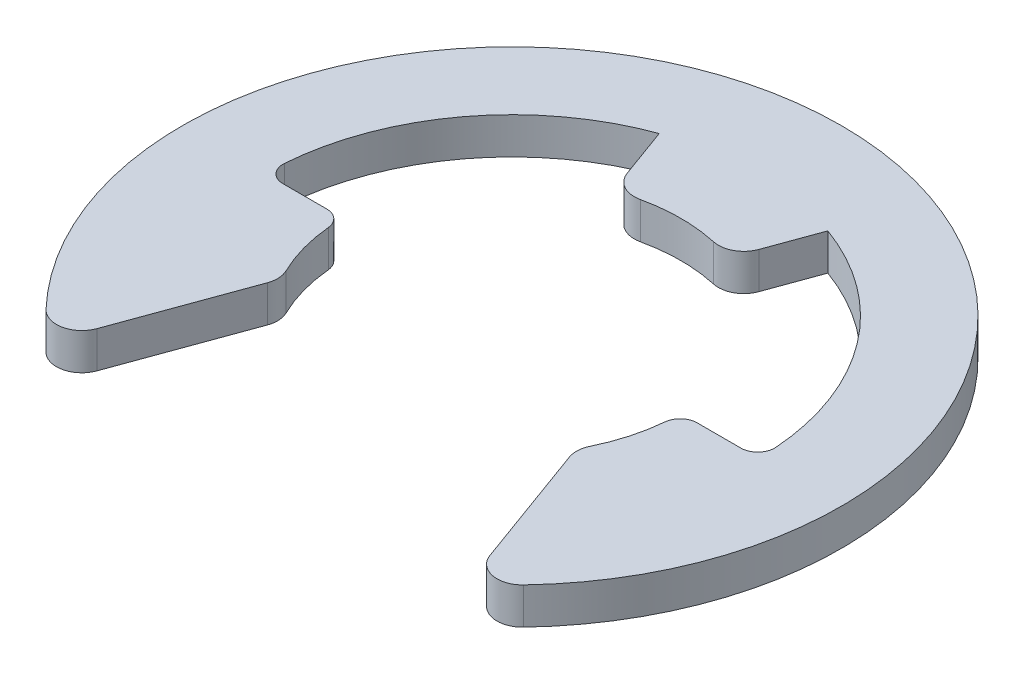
ISO-10303-21;
HEADER;
FILE_DESCRIPTION(('STEP AP214'),'2;1');
FILE_NAME('part.step','',(''),(''),'','','');
FILE_SCHEMA(('AUTOMOTIVE_DESIGN { 1 0 10303 214 1 1 1 1 }'));
ENDSEC;
DATA;
#1=APPLICATION_CONTEXT('core data for automotive mechanical design processes');
#2=APPLICATION_PROTOCOL_DEFINITION('international standard','automotive_design',2000,#1);
#3=PRODUCT_CONTEXT('',#1,'mechanical');
#4=PRODUCT('Part','Part','',(#3));
#5=PRODUCT_RELATED_PRODUCT_CATEGORY('part','',(#4));
#6=PRODUCT_DEFINITION_FORMATION('','',#4);
#7=PRODUCT_DEFINITION_CONTEXT('part definition',#1,'design');
#8=PRODUCT_DEFINITION('design','',#6,#7);
#9=PRODUCT_DEFINITION_SHAPE('','',#8);
#10=(LENGTH_UNIT() NAMED_UNIT(*) SI_UNIT(.MILLI.,.METRE.));
#11=(NAMED_UNIT(*) PLANE_ANGLE_UNIT() SI_UNIT($,.RADIAN.));
#12=(NAMED_UNIT(*) SI_UNIT($,.STERADIAN.) SOLID_ANGLE_UNIT());
#13=UNCERTAINTY_MEASURE_WITH_UNIT(LENGTH_MEASURE(1.E-05),#10,'distance_accuracy_value','');
#14=(GEOMETRIC_REPRESENTATION_CONTEXT(3) GLOBAL_UNCERTAINTY_ASSIGNED_CONTEXT((#13)) GLOBAL_UNIT_ASSIGNED_CONTEXT((#10,
#11,#12)) REPRESENTATION_CONTEXT('',''));
#15=CARTESIAN_POINT('',(0.,0.,0.));
#16=DIRECTION('',(0.,0.,1.));
#17=DIRECTION('',(1.,0.,0.));
#18=AXIS2_PLACEMENT_3D('',#15,#16,#17);
#19=CARTESIAN_POINT('',(0.,0.65,0.));
#20=DIRECTION('',(0.,-1.,0.));
#21=DIRECTION('',(0.,0.,-1.));
#22=AXIS2_PLACEMENT_3D('',#19,#20,#21);
#23=CYLINDRICAL_SURFACE('',#22,8.75);
#24=CARTESIAN_POINT('',(0.,0.65,0.));
#25=DIRECTION('',(0.,-1.,0.));
#26=DIRECTION('',(0.,0.,1.));
#27=AXIS2_PLACEMENT_3D('',#24,#25,#26);
#28=CIRCLE('',#27,8.75);
#29=CARTESIAN_POINT('',(-8.72625593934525,0.65,-0.644171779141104));
#30=VERTEX_POINT('',#29);
#31=CARTESIAN_POINT('',(-2.99267625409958,0.65,-8.22231043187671));
#32=VERTEX_POINT('',#31);
#33=EDGE_CURVE('E187',#30,#32,#28,.T.);
#34=ORIENTED_EDGE('',*,*,#33,.F.);
#35=DIRECTION('',(0.,-1.,0.));
#36=VECTOR('',#35,1.);
#37=CARTESIAN_POINT('',(-8.72625593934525,0.65,-0.644171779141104));
#38=LINE('',#37,#36);
#39=CARTESIAN_POINT('',(-8.72625593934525,-0.65,-0.644171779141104));
#40=VERTEX_POINT('',#39);
#41=EDGE_CURVE('E327',#30,#40,#38,.T.);
#42=ORIENTED_EDGE('',*,*,#41,.T.);
#43=CARTESIAN_POINT('',(0.,-0.65,0.));
#44=DIRECTION('',(0.,-1.,0.));
#45=DIRECTION('',(0.,0.,1.));
#46=AXIS2_PLACEMENT_3D('',#43,#44,#45);
#47=CIRCLE('',#46,8.75);
#48=CARTESIAN_POINT('',(-2.99267625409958,-0.65,-8.22231043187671));
#49=VERTEX_POINT('',#48);
#50=EDGE_CURVE('E211',#40,#49,#47,.T.);
#51=ORIENTED_EDGE('',*,*,#50,.T.);
#52=DIRECTION('',(0.,-1.,0.));
#53=VECTOR('',#52,1.);
#54=CARTESIAN_POINT('',(-2.99267625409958,0.65,-8.22231043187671));
#55=LINE('',#54,#53);
#56=EDGE_CURVE('E204',#32,#49,#55,.T.);
#57=ORIENTED_EDGE('',*,*,#56,.F.);
#58=EDGE_LOOP('',(#34,#42,#51,#57));
#59=FACE_BOUND('',#58,.T.);
#60=ADVANCED_FACE('F39',(#59),#23,.F.);
#61=CARTESIAN_POINT('',(-2.99267625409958,0.65,-8.22231043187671));
#62=DIRECTION('',(0.93969262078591,0.,-0.342020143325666));
#63=DIRECTION('',(-0.342020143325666,0.,-0.93969262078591));
#64=AXIS2_PLACEMENT_3D('',#61,#62,#63);
#65=PLANE('',#64);
#66=DIRECTION('',(0.342020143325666,0.,0.93969262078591));
#67=VECTOR('',#66,1.);
#68=CARTESIAN_POINT('',(-2.99267625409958,-0.65,-8.22231043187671));
#69=LINE('',#68,#67);
#70=CARTESIAN_POINT('',(-2.33977777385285,-0.65,-6.42848660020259));
#71=VERTEX_POINT('',#70);
#72=EDGE_CURVE('E447',#49,#71,#69,.T.);
#73=ORIENTED_EDGE('',*,*,#72,.T.);
#74=DIRECTION('',(0.,-1.,0.));
#75=VECTOR('',#74,1.);
#76=CARTESIAN_POINT('',(-2.33977777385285,0.65,-6.42848660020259));
#77=LINE('',#76,#75);
#78=CARTESIAN_POINT('',(-2.33977777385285,0.65,-6.42848660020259));
#79=VERTEX_POINT('',#78);
#80=EDGE_CURVE('E206',#71,#79,#77,.F.);
#81=ORIENTED_EDGE('',*,*,#80,.T.);
#82=DIRECTION('',(0.342020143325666,0.,0.93969262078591));
#83=VECTOR('',#82,1.);
#84=CARTESIAN_POINT('',(-2.99267625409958,0.65,-8.22231043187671));
#85=LINE('',#84,#83);
#86=EDGE_CURVE('E191',#32,#79,#85,.T.);
#87=ORIENTED_EDGE('',*,*,#86,.F.);
#88=ORIENTED_EDGE('',*,*,#56,.T.);
#89=EDGE_LOOP('',(#73,#81,#87,#88));
#90=FACE_BOUND('',#89,.T.);
#91=ADVANCED_FACE('F203',(#90),#65,.F.);
#92=CARTESIAN_POINT('',(0.,0.65,0.));
#93=DIRECTION('',(0.,-1.,0.));
#94=DIRECTION('',(0.,0.,-1.));
#95=AXIS2_PLACEMENT_3D('',#92,#93,#94);
#96=CYLINDRICAL_SURFACE('',#95,6.);
#97=CARTESIAN_POINT('',(0.,-0.65,0.));
#98=DIRECTION('',(0.,-1.,0.));
#99=DIRECTION('',(0.,0.,1.));
#100=AXIS2_PLACEMENT_3D('',#97,#98,#99);
#101=CIRCLE('',#100,6.);
#102=CARTESIAN_POINT('',(-1.29917775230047,-0.65,-5.85765628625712));
#103=VERTEX_POINT('',#102);
#104=CARTESIAN_POINT('',(1.29917775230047,-0.65,-5.85765628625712));
#105=VERTEX_POINT('',#104);
#106=EDGE_CURVE('E450',#103,#105,#101,.T.);
#107=ORIENTED_EDGE('',*,*,#106,.T.);
#108=DIRECTION('',(0.,-1.,0.));
#109=VECTOR('',#108,1.);
#110=CARTESIAN_POINT('',(1.29917775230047,0.65,-5.85765628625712));
#111=LINE('',#110,#109);
#112=CARTESIAN_POINT('',(1.29917775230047,0.65,-5.85765628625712));
#113=VERTEX_POINT('',#112);
#114=EDGE_CURVE('E290',#105,#113,#111,.F.);
#115=ORIENTED_EDGE('',*,*,#114,.T.);
#116=CARTESIAN_POINT('',(0.,0.65,0.));
#117=DIRECTION('',(0.,-1.,0.));
#118=DIRECTION('',(0.,0.,1.));
#119=AXIS2_PLACEMENT_3D('',#116,#117,#118);
#120=CIRCLE('',#119,6.);
#121=CARTESIAN_POINT('',(-1.29917775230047,0.65,-5.85765628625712));
#122=VERTEX_POINT('',#121);
#123=EDGE_CURVE('E208',#122,#113,#120,.T.);
#124=ORIENTED_EDGE('',*,*,#123,.F.);
#125=DIRECTION('',(0.,-1.,0.));
#126=VECTOR('',#125,1.);
#127=CARTESIAN_POINT('',(-1.29917775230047,0.65,-5.85765628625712));
#128=LINE('',#127,#126);
#129=EDGE_CURVE('E286',#122,#103,#128,.T.);
#130=ORIENTED_EDGE('',*,*,#129,.T.);
#131=EDGE_LOOP('',(#107,#115,#124,#130));
#132=FACE_BOUND('',#131,.T.);
#133=ADVANCED_FACE('F371',(#132),#96,.F.);
#134=CARTESIAN_POINT('',(2.052120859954,0.65,-5.63815572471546));
#135=DIRECTION('',(-0.93969262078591,0.,-0.342020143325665));
#136=DIRECTION('',(-0.342020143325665,0.,0.93969262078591));
#137=AXIS2_PLACEMENT_3D('',#134,#135,#136);
#138=PLANE('',#137);
#139=DIRECTION('',(0.342020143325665,0.,-0.93969262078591));
#140=VECTOR('',#139,1.);
#141=CARTESIAN_POINT('',(2.052120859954,0.65,-5.63815572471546));
#142=LINE('',#141,#140);
#143=CARTESIAN_POINT('',(2.33977777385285,0.65,-6.42848660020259));
#144=VERTEX_POINT('',#143);
#145=CARTESIAN_POINT('',(2.99267625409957,0.65,-8.22231043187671));
#146=VERTEX_POINT('',#145);
#147=EDGE_CURVE('E424',#144,#146,#142,.T.);
#148=ORIENTED_EDGE('',*,*,#147,.F.);
#149=DIRECTION('',(0.,-1.,0.));
#150=VECTOR('',#149,1.);
#151=CARTESIAN_POINT('',(2.33977777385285,0.65,-6.42848660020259));
#152=LINE('',#151,#150);
#153=CARTESIAN_POINT('',(2.33977777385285,-0.65,-6.42848660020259));
#154=VERTEX_POINT('',#153);
#155=EDGE_CURVE('E282',#144,#154,#152,.T.);
#156=ORIENTED_EDGE('',*,*,#155,.T.);
#157=DIRECTION('',(0.342020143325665,0.,-0.93969262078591));
#158=VECTOR('',#157,1.);
#159=CARTESIAN_POINT('',(2.052120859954,-0.65,-5.63815572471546));
#160=LINE('',#159,#158);
#161=CARTESIAN_POINT('',(2.99267625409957,-0.65,-8.22231043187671));
#162=VERTEX_POINT('',#161);
#163=EDGE_CURVE('E454',#154,#162,#160,.T.);
#164=ORIENTED_EDGE('',*,*,#163,.T.);
#165=DIRECTION('',(0.,-1.,0.));
#166=VECTOR('',#165,1.);
#167=CARTESIAN_POINT('',(2.99267625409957,0.65,-8.22231043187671));
#168=LINE('',#167,#166);
#169=EDGE_CURVE('E215',#146,#162,#168,.T.);
#170=ORIENTED_EDGE('',*,*,#169,.F.);
#171=EDGE_LOOP('',(#148,#156,#164,#170));
#172=FACE_BOUND('',#171,.T.);
#173=ADVANCED_FACE('F527',(#172),#138,.F.);
#174=CARTESIAN_POINT('',(0.,0.65,0.));
#175=DIRECTION('',(0.,-1.,0.));
#176=DIRECTION('',(0.,0.,-1.));
#177=AXIS2_PLACEMENT_3D('',#174,#175,#176);
#178=CYLINDRICAL_SURFACE('',#177,8.75);
#179=CARTESIAN_POINT('',(0.,-0.65,0.));
#180=DIRECTION('',(0.,-1.,0.));
#181=DIRECTION('',(0.,0.,1.));
#182=AXIS2_PLACEMENT_3D('',#179,#180,#181);
#183=CIRCLE('',#182,8.75);
#184=CARTESIAN_POINT('',(8.72625593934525,-0.65,-0.644171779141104));
#185=VERTEX_POINT('',#184);
#186=EDGE_CURVE('E457',#162,#185,#183,.T.);
#187=ORIENTED_EDGE('',*,*,#186,.T.);
#188=DIRECTION('',(0.,-1.,0.));
#189=VECTOR('',#188,1.);
#190=CARTESIAN_POINT('',(8.72625593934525,0.65,-0.644171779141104));
#191=LINE('',#190,#189);
#192=CARTESIAN_POINT('',(8.72625593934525,0.65,-0.644171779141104));
#193=VERTEX_POINT('',#192);
#194=EDGE_CURVE('E308',#185,#193,#191,.F.);
#195=ORIENTED_EDGE('',*,*,#194,.T.);
#196=CARTESIAN_POINT('',(0.,0.65,0.));
#197=DIRECTION('',(0.,-1.,0.));
#198=DIRECTION('',(0.,0.,1.));
#199=AXIS2_PLACEMENT_3D('',#196,#197,#198);
#200=CIRCLE('',#199,8.75);
#201=EDGE_CURVE('E411',#146,#193,#200,.T.);
#202=ORIENTED_EDGE('',*,*,#201,.F.);
#203=ORIENTED_EDGE('',*,*,#169,.T.);
#204=EDGE_LOOP('',(#187,#195,#202,#203));
#205=FACE_BOUND('',#204,.T.);
#206=ADVANCED_FACE('F521',(#205),#178,.F.);
#207=CARTESIAN_POINT('',(6.,0.65,0.));
#208=DIRECTION('',(0.,0.,1.));
#209=DIRECTION('',(1.,0.,0.));
#210=AXIS2_PLACEMENT_3D('',#207,#208,#209);
#211=PLANE('',#210);
#212=DIRECTION('',(-1.,0.,0.));
#213=VECTOR('',#212,1.);
#214=CARTESIAN_POINT('',(6.,0.65,0.));
#215=LINE('',#214,#213);
#216=CARTESIAN_POINT('',(8.12788410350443,0.65,0.));
#217=VERTEX_POINT('',#216);
#218=CARTESIAN_POINT('',(6.57267069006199,0.65,0.));
#219=VERTEX_POINT('',#218);
#220=EDGE_CURVE('E408',#217,#219,#215,.T.);
#221=ORIENTED_EDGE('',*,*,#220,.F.);
#222=DIRECTION('',(0.,1.,0.));
#223=VECTOR('',#222,1.);
#224=CARTESIAN_POINT('',(8.12788410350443,-0.65,0.));
#225=LINE('',#224,#223);
#226=CARTESIAN_POINT('',(8.12788410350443,-0.65,0.));
#227=VERTEX_POINT('',#226);
#228=EDGE_CURVE('E305',#217,#227,#225,.F.);
#229=ORIENTED_EDGE('',*,*,#228,.T.);
#230=DIRECTION('',(-1.,0.,0.));
#231=VECTOR('',#230,1.);
#232=CARTESIAN_POINT('',(6.,-0.65,0.));
#233=LINE('',#232,#231);
#234=CARTESIAN_POINT('',(6.57267069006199,-0.65,0.));
#235=VERTEX_POINT('',#234);
#236=EDGE_CURVE('E461',#227,#235,#233,.T.);
#237=ORIENTED_EDGE('',*,*,#236,.T.);
#238=DIRECTION('',(0.,-1.,0.));
#239=VECTOR('',#238,1.);
#240=CARTESIAN_POINT('',(6.57267069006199,0.65,0.));
#241=LINE('',#240,#239);
#242=EDGE_CURVE('E302',#235,#219,#241,.F.);
#243=ORIENTED_EDGE('',*,*,#242,.T.);
#244=EDGE_LOOP('',(#221,#229,#237,#243));
#245=FACE_BOUND('',#244,.T.);
#246=ADVANCED_FACE('F413',(#245),#211,.F.);
#247=CARTESIAN_POINT('',(0.,0.65,0.));
#248=DIRECTION('',(0.,-1.,0.));
#249=DIRECTION('',(0.,0.,-1.));
#250=AXIS2_PLACEMENT_3D('',#247,#248,#249);
#251=CYLINDRICAL_SURFACE('',#250,6.);
#252=CARTESIAN_POINT('',(0.,0.65,0.));
#253=DIRECTION('',(0.,-1.,0.));
#254=DIRECTION('',(0.,0.,1.));
#255=AXIS2_PLACEMENT_3D('',#252,#253,#254);
#256=CIRCLE('',#255,6.);
#257=CARTESIAN_POINT('',(5.97515517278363,0.65,0.545454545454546));
#258=VERTEX_POINT('',#257);
#259=CARTESIAN_POINT('',(5.39698560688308,0.65,2.62155418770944));
#260=VERTEX_POINT('',#259);
#261=EDGE_CURVE('E418',#258,#260,#256,.T.);
#262=ORIENTED_EDGE('',*,*,#261,.F.);
#263=DIRECTION('',(0.,-1.,0.));
#264=VECTOR('',#263,1.);
#265=CARTESIAN_POINT('',(5.97515517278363,0.65,0.545454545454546));
#266=LINE('',#265,#264);
#267=CARTESIAN_POINT('',(5.97515517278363,-0.65,0.545454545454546));
#268=VERTEX_POINT('',#267);
#269=EDGE_CURVE('E311',#258,#268,#266,.T.);
#270=ORIENTED_EDGE('',*,*,#269,.T.);
#271=CARTESIAN_POINT('',(0.,-0.65,0.));
#272=DIRECTION('',(0.,-1.,0.));
#273=DIRECTION('',(0.,0.,1.));
#274=AXIS2_PLACEMENT_3D('',#271,#272,#273);
#275=CIRCLE('',#274,6.);
#276=CARTESIAN_POINT('',(5.39698560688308,-0.65,2.62155418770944));
#277=VERTEX_POINT('',#276);
#278=EDGE_CURVE('E464',#268,#277,#275,.T.);
#279=ORIENTED_EDGE('',*,*,#278,.T.);
#280=DIRECTION('',(0.,-1.,0.));
#281=VECTOR('',#280,1.);
#282=CARTESIAN_POINT('',(5.39698560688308,0.65,2.62155418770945));
#283=LINE('',#282,#281);
#284=EDGE_CURVE('E250',#277,#260,#283,.F.);
#285=ORIENTED_EDGE('',*,*,#284,.T.);
#286=EDGE_LOOP('',(#262,#270,#279,#285));
#287=FACE_BOUND('',#286,.T.);
#288=ADVANCED_FACE('F512',(#287),#251,.F.);
#289=CARTESIAN_POINT('',(5.22499999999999,0.65,2.94947029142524));
#290=DIRECTION('',(0.939692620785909,0.,-0.342020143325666));
#291=DIRECTION('',(-0.342020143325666,0.,-0.939692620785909));
#292=AXIS2_PLACEMENT_3D('',#289,#290,#291);
#293=PLANE('',#292);
#294=DIRECTION('',(0.342020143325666,0.,0.939692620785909));
#295=VECTOR('',#294,1.);
#296=CARTESIAN_POINT('',(5.22499999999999,0.65,2.94947029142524));
#297=LINE('',#296,#295);
#298=CARTESIAN_POINT('',(5.36081008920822,0.65,3.32260544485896));
#299=VERTEX_POINT('',#298);
#300=CARTESIAN_POINT('',(6.97460574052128,0.65,7.75647255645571));
#301=VERTEX_POINT('',#300);
#302=EDGE_CURVE('E421',#299,#301,#297,.T.);
#303=ORIENTED_EDGE('',*,*,#302,.F.);
#304=DIRECTION('',(0.,-1.,0.));
#305=VECTOR('',#304,1.);
#306=CARTESIAN_POINT('',(5.36081008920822,0.65,3.32260544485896));
#307=LINE('',#306,#305);
#308=CARTESIAN_POINT('',(5.36081008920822,-0.65,3.32260544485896));
#309=VERTEX_POINT('',#308);
#310=EDGE_CURVE('E220',#299,#309,#307,.T.);
#311=ORIENTED_EDGE('',*,*,#310,.T.);
#312=DIRECTION('',(0.342020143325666,0.,0.939692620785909));
#313=VECTOR('',#312,1.);
#314=CARTESIAN_POINT('',(5.22499999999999,-0.65,2.94947029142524));
#315=LINE('',#314,#313);
#316=CARTESIAN_POINT('',(6.97460574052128,-0.65,7.75647255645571));
#317=VERTEX_POINT('',#316);
#318=EDGE_CURVE('E467',#309,#317,#315,.T.);
#319=ORIENTED_EDGE('',*,*,#318,.T.);
#320=DIRECTION('',(0.,-1.,0.));
#321=VECTOR('',#320,1.);
#322=CARTESIAN_POINT('',(6.97460574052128,0.65,7.75647255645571));
#323=LINE('',#322,#321);
#324=EDGE_CURVE('E214',#317,#301,#323,.F.);
#325=ORIENTED_EDGE('',*,*,#324,.T.);
#326=EDGE_LOOP('',(#303,#311,#319,#325));
#327=FACE_BOUND('',#326,.T.);
#328=ADVANCED_FACE('F506',(#327),#293,.F.);
#329=CARTESIAN_POINT('',(0.,0.65,0.));
#330=DIRECTION('',(0.,-1.,0.));
#331=DIRECTION('',(0.,0.,-1.));
#332=AXIS2_PLACEMENT_3D('',#329,#330,#331);
#333=CYLINDRICAL_SURFACE('',#332,11.7);
#334=CARTESIAN_POINT('',(0.,0.65,0.));
#335=DIRECTION('',(0.,1.,0.));
#336=DIRECTION('',(0.,0.,1.));
#337=AXIS2_PLACEMENT_3D('',#334,#335,#336);
#338=CIRCLE('',#337,11.7);
#339=CARTESIAN_POINT('',(8.47202319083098,0.65,8.06937562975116));
#340=VERTEX_POINT('',#339);
#341=CARTESIAN_POINT('',(-8.47202319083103,0.65,8.06937562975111));
#342=VERTEX_POINT('',#341);
#343=EDGE_CURVE('E431',#340,#342,#338,.T.);
#344=ORIENTED_EDGE('',*,*,#343,.F.);
#345=DIRECTION('',(0.,-1.,0.));
#346=VECTOR('',#345,1.);
#347=CARTESIAN_POINT('',(8.47202319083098,0.65,8.06937562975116));
#348=LINE('',#347,#346);
#349=CARTESIAN_POINT('',(8.47202319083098,-0.65,8.06937562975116));
#350=VERTEX_POINT('',#349);
#351=EDGE_CURVE('E298',#340,#350,#348,.T.);
#352=ORIENTED_EDGE('',*,*,#351,.T.);
#353=CARTESIAN_POINT('',(0.,-0.65,0.));
#354=DIRECTION('',(0.,1.,0.));
#355=DIRECTION('',(0.,0.,1.));
#356=AXIS2_PLACEMENT_3D('',#353,#354,#355);
#357=CIRCLE('',#356,11.7);
#358=CARTESIAN_POINT('',(-8.47202319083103,-0.65,8.06937562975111));
#359=VERTEX_POINT('',#358);
#360=EDGE_CURVE('E471',#350,#359,#357,.T.);
#361=ORIENTED_EDGE('',*,*,#360,.T.);
#362=DIRECTION('',(0.,-1.,0.));
#363=VECTOR('',#362,1.);
#364=CARTESIAN_POINT('',(-8.47202319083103,0.65,8.06937562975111));
#365=LINE('',#364,#363);
#366=EDGE_CURVE('E295',#359,#342,#365,.F.);
#367=ORIENTED_EDGE('',*,*,#366,.T.);
#368=EDGE_LOOP('',(#344,#352,#361,#367));
#369=FACE_BOUND('',#368,.T.);
#370=ADVANCED_FACE('F499',(#369),#333,.T.);
#371=CARTESIAN_POINT('',(-7.43849299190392,0.65,9.03099230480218));
#372=DIRECTION('',(-0.939692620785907,0.,-0.342020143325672));
#373=DIRECTION('',(-0.342020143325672,0.,0.939692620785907));
#374=AXIS2_PLACEMENT_3D('',#371,#372,#373);
#375=PLANE('',#374);
#376=DIRECTION('',(0.342020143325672,0.,-0.939692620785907));
#377=VECTOR('',#376,1.);
#378=CARTESIAN_POINT('',(-7.43849299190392,-0.65,9.03099230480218));
#379=LINE('',#378,#377);
#380=CARTESIAN_POINT('',(-6.97460574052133,-0.65,7.75647255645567));
#381=VERTEX_POINT('',#380);
#382=CARTESIAN_POINT('',(-5.36081008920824,-0.65,3.32260544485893));
#383=VERTEX_POINT('',#382);
#384=EDGE_CURVE('E475',#381,#383,#379,.T.);
#385=ORIENTED_EDGE('',*,*,#384,.T.);
#386=DIRECTION('',(0.,-1.,0.));
#387=VECTOR('',#386,1.);
#388=CARTESIAN_POINT('',(-5.36081008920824,0.65,3.32260544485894));
#389=LINE('',#388,#387);
#390=CARTESIAN_POINT('',(-5.36081008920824,0.65,3.32260544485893));
#391=VERTEX_POINT('',#390);
#392=EDGE_CURVE('E279',#383,#391,#389,.F.);
#393=ORIENTED_EDGE('',*,*,#392,.T.);
#394=DIRECTION('',(0.342020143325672,0.,-0.939692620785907));
#395=VECTOR('',#394,1.);
#396=CARTESIAN_POINT('',(-7.43849299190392,0.65,9.03099230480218));
#397=LINE('',#396,#395);
#398=CARTESIAN_POINT('',(-6.97460574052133,0.65,7.75647255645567));
#399=VERTEX_POINT('',#398);
#400=EDGE_CURVE('E435',#399,#391,#397,.T.);
#401=ORIENTED_EDGE('',*,*,#400,.F.);
#402=DIRECTION('',(0.,-1.,0.));
#403=VECTOR('',#402,1.);
#404=CARTESIAN_POINT('',(-6.97460574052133,0.65,7.75647255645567));
#405=LINE('',#404,#403);
#406=EDGE_CURVE('E275',#399,#381,#405,.T.);
#407=ORIENTED_EDGE('',*,*,#406,.T.);
#408=EDGE_LOOP('',(#385,#393,#401,#407));
#409=FACE_BOUND('',#408,.T.);
#410=ADVANCED_FACE('F491',(#409),#375,.F.);
#411=CARTESIAN_POINT('',(0.,0.65,0.));
#412=DIRECTION('',(0.,-1.,0.));
#413=DIRECTION('',(0.,0.,-1.));
#414=AXIS2_PLACEMENT_3D('',#411,#412,#413);
#415=CYLINDRICAL_SURFACE('',#414,6.);
#416=CARTESIAN_POINT('',(0.,-0.65,0.));
#417=DIRECTION('',(0.,-1.,0.));
#418=DIRECTION('',(0.,0.,1.));
#419=AXIS2_PLACEMENT_3D('',#416,#417,#418);
#420=CIRCLE('',#419,6.);
#421=CARTESIAN_POINT('',(-5.39698560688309,-0.65,2.62155418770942));
#422=VERTEX_POINT('',#421);
#423=CARTESIAN_POINT('',(-5.97515517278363,-0.65,0.545454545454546));
#424=VERTEX_POINT('',#423);
#425=EDGE_CURVE('E354',#422,#424,#420,.T.);
#426=ORIENTED_EDGE('',*,*,#425,.T.);
#427=DIRECTION('',(0.,-1.,0.));
#428=VECTOR('',#427,1.);
#429=CARTESIAN_POINT('',(-5.97515517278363,0.65,0.545454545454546));
#430=LINE('',#429,#428);
#431=CARTESIAN_POINT('',(-5.97515517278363,0.65,0.545454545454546));
#432=VERTEX_POINT('',#431);
#433=EDGE_CURVE('E336',#424,#432,#430,.F.);
#434=ORIENTED_EDGE('',*,*,#433,.T.);
#435=CARTESIAN_POINT('',(0.,0.65,0.));
#436=DIRECTION('',(0.,-1.,0.));
#437=DIRECTION('',(0.,0.,1.));
#438=AXIS2_PLACEMENT_3D('',#435,#436,#437);
#439=CIRCLE('',#438,6.);
#440=CARTESIAN_POINT('',(-5.39698560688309,0.65,2.62155418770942));
#441=VERTEX_POINT('',#440);
#442=EDGE_CURVE('E439',#441,#432,#439,.T.);
#443=ORIENTED_EDGE('',*,*,#442,.F.);
#444=DIRECTION('',(0.,-1.,0.));
#445=VECTOR('',#444,1.);
#446=CARTESIAN_POINT('',(-5.39698560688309,0.65,2.62155418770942));
#447=LINE('',#446,#445);
#448=EDGE_CURVE('E271',#441,#422,#447,.T.);
#449=ORIENTED_EDGE('',*,*,#448,.T.);
#450=EDGE_LOOP('',(#426,#434,#443,#449));
#451=FACE_BOUND('',#450,.T.);
#452=ADVANCED_FACE('F483',(#451),#415,.F.);
#453=CARTESIAN_POINT('',(-6.,0.65,0.));
#454=DIRECTION('',(0.,0.,1.));
#455=DIRECTION('',(1.,0.,0.));
#456=AXIS2_PLACEMENT_3D('',#453,#454,#455);
#457=PLANE('',#456);
#458=DIRECTION('',(-1.,0.,0.));
#459=VECTOR('',#458,1.);
#460=CARTESIAN_POINT('',(-6.,-0.65,0.));
#461=LINE('',#460,#459);
#462=CARTESIAN_POINT('',(-6.57267069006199,-0.65,0.));
#463=VERTEX_POINT('',#462);
#464=CARTESIAN_POINT('',(-8.12788410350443,-0.65,0.));
#465=VERTEX_POINT('',#464);
#466=EDGE_CURVE('E198',#463,#465,#461,.T.);
#467=ORIENTED_EDGE('',*,*,#466,.T.);
#468=DIRECTION('',(0.,1.,0.));
#469=VECTOR('',#468,1.);
#470=CARTESIAN_POINT('',(-8.12788410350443,0.65,0.));
#471=LINE('',#470,#469);
#472=CARTESIAN_POINT('',(-8.12788410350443,0.65,0.));
#473=VERTEX_POINT('',#472);
#474=EDGE_CURVE('E61',#465,#473,#471,.T.);
#475=ORIENTED_EDGE('',*,*,#474,.T.);
#476=DIRECTION('',(-1.,0.,0.));
#477=VECTOR('',#476,1.);
#478=CARTESIAN_POINT('',(-6.,0.65,0.));
#479=LINE('',#478,#477);
#480=CARTESIAN_POINT('',(-6.57267069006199,0.65,0.));
#481=VERTEX_POINT('',#480);
#482=EDGE_CURVE('E224',#481,#473,#479,.T.);
#483=ORIENTED_EDGE('',*,*,#482,.F.);
#484=DIRECTION('',(0.,-1.,0.));
#485=VECTOR('',#484,1.);
#486=CARTESIAN_POINT('',(-6.57267069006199,0.65,0.));
#487=LINE('',#486,#485);
#488=EDGE_CURVE('E330',#481,#463,#487,.T.);
#489=ORIENTED_EDGE('',*,*,#488,.T.);
#490=EDGE_LOOP('',(#467,#475,#483,#489));
#491=FACE_BOUND('',#490,.T.);
#492=ADVANCED_FACE('F351',(#491),#457,.F.);
#493=CARTESIAN_POINT('',(0.,0.65,0.));
#494=DIRECTION('',(0.,1.,0.));
#495=DIRECTION('',(0.,0.,1.));
#496=AXIS2_PLACEMENT_3D('',#493,#494,#495);
#497=PLANE('',#496);
#498=ORIENTED_EDGE('',*,*,#220,.T.);
#499=CARTESIAN_POINT('',(6.57267069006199,0.65,0.6));
#500=DIRECTION('',(0.,1.,0.));
#501=DIRECTION('',(0.,0.,1.));
#502=AXIS2_PLACEMENT_3D('',#499,#500,#501);
#503=CIRCLE('',#502,0.6);
#504=EDGE_CURVE('E324',#219,#258,#503,.T.);
#505=ORIENTED_EDGE('',*,*,#504,.T.);
#506=ORIENTED_EDGE('',*,*,#261,.T.);
#507=CARTESIAN_POINT('',(6.20653344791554,0.65,3.01478731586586));
#508=DIRECTION('',(0.,1.,0.));
#509=DIRECTION('',(0.,0.,1.));
#510=AXIS2_PLACEMENT_3D('',#507,#508,#509);
#511=CIRCLE('',#510,0.9);
#512=EDGE_CURVE('E268',#260,#299,#511,.T.);
#513=ORIENTED_EDGE('',*,*,#512,.T.);
#514=ORIENTED_EDGE('',*,*,#302,.T.);
#515=CARTESIAN_POINT('',(7.8203290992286,0.65,7.44865442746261));
#516=DIRECTION('',(0.,1.,0.));
#517=DIRECTION('',(0.,0.,1.));
#518=AXIS2_PLACEMENT_3D('',#515,#516,#517);
#519=CIRCLE('',#518,0.9);
#520=EDGE_CURVE('E257',#301,#340,#519,.T.);
#521=ORIENTED_EDGE('',*,*,#520,.T.);
#522=ORIENTED_EDGE('',*,*,#343,.T.);
#523=CARTESIAN_POINT('',(-7.82032909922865,0.65,7.44865442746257));
#524=DIRECTION('',(0.,1.,0.));
#525=DIRECTION('',(0.,0.,1.));
#526=AXIS2_PLACEMENT_3D('',#523,#524,#525);
#527=CIRCLE('',#526,0.9);
#528=EDGE_CURVE('E254',#342,#399,#527,.T.);
#529=ORIENTED_EDGE('',*,*,#528,.T.);
#530=ORIENTED_EDGE('',*,*,#400,.T.);
#531=CARTESIAN_POINT('',(-6.20653344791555,0.65,3.01478731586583));
#532=DIRECTION('',(0.,1.,0.));
#533=DIRECTION('',(0.,0.,1.));
#534=AXIS2_PLACEMENT_3D('',#531,#532,#533);
#535=CIRCLE('',#534,0.9);
#536=EDGE_CURVE('E265',#391,#441,#535,.T.);
#537=ORIENTED_EDGE('',*,*,#536,.T.);
#538=ORIENTED_EDGE('',*,*,#442,.T.);
#539=CARTESIAN_POINT('',(-6.57267069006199,0.65,0.6));
#540=DIRECTION('',(0.,1.,0.));
#541=DIRECTION('',(0.,0.,1.));
#542=AXIS2_PLACEMENT_3D('',#539,#540,#541);
#543=CIRCLE('',#542,0.6);
#544=EDGE_CURVE('E321',#432,#481,#543,.T.);
#545=ORIENTED_EDGE('',*,*,#544,.T.);
#546=ORIENTED_EDGE('',*,*,#482,.T.);
#547=CARTESIAN_POINT('',(-8.12788410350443,0.65,-0.6));
#548=DIRECTION('',(0.,1.,0.));
#549=DIRECTION('',(0.,0.,1.));
#550=AXIS2_PLACEMENT_3D('',#547,#548,#549);
#551=CIRCLE('',#550,0.6);
#552=EDGE_CURVE('E11',#473,#30,#551,.F.);
#553=ORIENTED_EDGE('',*,*,#552,.T.);
#554=ORIENTED_EDGE('',*,*,#33,.T.);
#555=ORIENTED_EDGE('',*,*,#86,.T.);
#556=CARTESIAN_POINT('',(-1.49405441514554,0.65,-6.73630472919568));
#557=DIRECTION('',(0.,1.,0.));
#558=DIRECTION('',(0.,0.,1.));
#559=AXIS2_PLACEMENT_3D('',#556,#557,#558);
#560=CIRCLE('',#559,0.9);
#561=EDGE_CURVE('E260',#79,#122,#560,.T.);
#562=ORIENTED_EDGE('',*,*,#561,.T.);
#563=ORIENTED_EDGE('',*,*,#123,.T.);
#564=CARTESIAN_POINT('',(1.49405441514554,0.65,-6.73630472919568));
#565=DIRECTION('',(0.,1.,0.));
#566=DIRECTION('',(0.,0.,1.));
#567=AXIS2_PLACEMENT_3D('',#564,#565,#566);
#568=CIRCLE('',#567,0.9);
#569=EDGE_CURVE('E263',#113,#144,#568,.T.);
#570=ORIENTED_EDGE('',*,*,#569,.T.);
#571=ORIENTED_EDGE('',*,*,#147,.T.);
#572=ORIENTED_EDGE('',*,*,#201,.T.);
#573=CARTESIAN_POINT('',(8.12788410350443,0.65,-0.6));
#574=DIRECTION('',(0.,1.,0.));
#575=DIRECTION('',(0.,0.,1.));
#576=AXIS2_PLACEMENT_3D('',#573,#574,#575);
#577=CIRCLE('',#576,0.6);
#578=EDGE_CURVE('E342',#193,#217,#577,.F.);
#579=ORIENTED_EDGE('',*,*,#578,.T.);
#580=EDGE_LOOP('',(#498,#505,#506,#513,#514,#521,#522,#529,#530,#537,#538,#545,#546,#553,#554,
#555,#562,#563,#570,#571,#572,#579));
#581=FACE_BOUND('',#580,.T.);
#582=ADVANCED_FACE('F190',(#581),#497,.T.);
#583=CARTESIAN_POINT('',(0.,-0.65,0.));
#584=DIRECTION('',(0.,1.,0.));
#585=DIRECTION('',(0.,0.,1.));
#586=AXIS2_PLACEMENT_3D('',#583,#584,#585);
#587=PLANE('',#586);
#588=ORIENTED_EDGE('',*,*,#278,.F.);
#589=CARTESIAN_POINT('',(6.57267069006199,-0.65,0.6));
#590=DIRECTION('',(0.,1.,0.));
#591=DIRECTION('',(0.,0.,1.));
#592=AXIS2_PLACEMENT_3D('',#589,#590,#591);
#593=CIRCLE('',#592,0.6);
#594=EDGE_CURVE('E318',#268,#235,#593,.F.);
#595=ORIENTED_EDGE('',*,*,#594,.T.);
#596=ORIENTED_EDGE('',*,*,#236,.F.);
#597=CARTESIAN_POINT('',(8.12788410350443,-0.65,-0.6));
#598=DIRECTION('',(0.,1.,0.));
#599=DIRECTION('',(0.,0.,1.));
#600=AXIS2_PLACEMENT_3D('',#597,#598,#599);
#601=CIRCLE('',#600,0.6);
#602=EDGE_CURVE('E339',#227,#185,#601,.T.);
#603=ORIENTED_EDGE('',*,*,#602,.T.);
#604=ORIENTED_EDGE('',*,*,#186,.F.);
#605=ORIENTED_EDGE('',*,*,#163,.F.);
#606=CARTESIAN_POINT('',(1.49405441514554,-0.65,-6.73630472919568));
#607=DIRECTION('',(0.,1.,0.));
#608=DIRECTION('',(0.,0.,1.));
#609=AXIS2_PLACEMENT_3D('',#606,#607,#608);
#610=CIRCLE('',#609,0.9);
#611=EDGE_CURVE('E240',#154,#105,#610,.F.);
#612=ORIENTED_EDGE('',*,*,#611,.T.);
#613=ORIENTED_EDGE('',*,*,#106,.F.);
#614=CARTESIAN_POINT('',(-1.49405441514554,-0.65,-6.73630472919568));
#615=DIRECTION('',(0.,1.,0.));
#616=DIRECTION('',(0.,0.,1.));
#617=AXIS2_PLACEMENT_3D('',#614,#615,#616);
#618=CIRCLE('',#617,0.9);
#619=EDGE_CURVE('E237',#103,#71,#618,.F.);
#620=ORIENTED_EDGE('',*,*,#619,.T.);
#621=ORIENTED_EDGE('',*,*,#72,.F.);
#622=ORIENTED_EDGE('',*,*,#50,.F.);
#623=CARTESIAN_POINT('',(-8.12788410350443,-0.65,-0.6));
#624=DIRECTION('',(0.,1.,0.));
#625=DIRECTION('',(0.,0.,1.));
#626=AXIS2_PLACEMENT_3D('',#623,#624,#625);
#627=CIRCLE('',#626,0.6);
#628=EDGE_CURVE('E48',#40,#465,#627,.T.);
#629=ORIENTED_EDGE('',*,*,#628,.T.);
#630=ORIENTED_EDGE('',*,*,#466,.F.);
#631=CARTESIAN_POINT('',(-6.57267069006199,-0.65,0.6));
#632=DIRECTION('',(0.,1.,0.));
#633=DIRECTION('',(0.,0.,1.));
#634=AXIS2_PLACEMENT_3D('',#631,#632,#633);
#635=CIRCLE('',#634,0.6);
#636=EDGE_CURVE('E315',#463,#424,#635,.F.);
#637=ORIENTED_EDGE('',*,*,#636,.T.);
#638=ORIENTED_EDGE('',*,*,#425,.F.);
#639=CARTESIAN_POINT('',(-6.20653344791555,-0.65,3.01478731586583));
#640=DIRECTION('',(0.,1.,0.));
#641=DIRECTION('',(0.,0.,1.));
#642=AXIS2_PLACEMENT_3D('',#639,#640,#641);
#643=CIRCLE('',#642,0.9);
#644=EDGE_CURVE('E243',#422,#383,#643,.F.);
#645=ORIENTED_EDGE('',*,*,#644,.T.);
#646=ORIENTED_EDGE('',*,*,#384,.F.);
#647=CARTESIAN_POINT('',(-7.82032909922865,-0.65,7.44865442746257));
#648=DIRECTION('',(0.,1.,0.));
#649=DIRECTION('',(0.,0.,1.));
#650=AXIS2_PLACEMENT_3D('',#647,#648,#649);
#651=CIRCLE('',#650,0.9);
#652=EDGE_CURVE('E231',#381,#359,#651,.F.);
#653=ORIENTED_EDGE('',*,*,#652,.T.);
#654=ORIENTED_EDGE('',*,*,#360,.F.);
#655=CARTESIAN_POINT('',(7.8203290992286,-0.65,7.44865442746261));
#656=DIRECTION('',(0.,1.,0.));
#657=DIRECTION('',(0.,0.,1.));
#658=AXIS2_PLACEMENT_3D('',#655,#656,#657);
#659=CIRCLE('',#658,0.9);
#660=EDGE_CURVE('E234',#350,#317,#659,.F.);
#661=ORIENTED_EDGE('',*,*,#660,.T.);
#662=ORIENTED_EDGE('',*,*,#318,.F.);
#663=CARTESIAN_POINT('',(6.20653344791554,-0.65,3.01478731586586));
#664=DIRECTION('',(0.,1.,0.));
#665=DIRECTION('',(0.,0.,1.));
#666=AXIS2_PLACEMENT_3D('',#663,#664,#665);
#667=CIRCLE('',#666,0.9);
#668=EDGE_CURVE('E246',#309,#277,#667,.F.);
#669=ORIENTED_EDGE('',*,*,#668,.T.);
#670=EDGE_LOOP('',(#588,#595,#596,#603,#604,#605,#612,#613,#620,#621,#622,#629,#630,#637,#638,
#645,#646,#653,#654,#661,#662,#669));
#671=FACE_BOUND('',#670,.T.);
#672=ADVANCED_FACE('F349',(#671),#587,.F.);
#673=CARTESIAN_POINT('',(6.20653344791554,0.65,3.01478731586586));
#674=DIRECTION('',(0.,-1.,0.));
#675=DIRECTION('',(0.,0.,-1.));
#676=AXIS2_PLACEMENT_3D('',#673,#674,#675);
#677=CYLINDRICAL_SURFACE('',#676,0.9);
#678=ORIENTED_EDGE('',*,*,#512,.F.);
#679=ORIENTED_EDGE('',*,*,#284,.F.);
#680=ORIENTED_EDGE('',*,*,#668,.F.);
#681=ORIENTED_EDGE('',*,*,#310,.F.);
#682=EDGE_LOOP('',(#678,#679,#680,#681));
#683=FACE_BOUND('',#682,.T.);
#684=ADVANCED_FACE('F375',(#683),#677,.T.);
#685=CARTESIAN_POINT('',(-6.20653344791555,0.65,3.01478731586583));
#686=DIRECTION('',(0.,-1.,0.));
#687=DIRECTION('',(0.,0.,-1.));
#688=AXIS2_PLACEMENT_3D('',#685,#686,#687);
#689=CYLINDRICAL_SURFACE('',#688,0.9);
#690=ORIENTED_EDGE('',*,*,#536,.F.);
#691=ORIENTED_EDGE('',*,*,#392,.F.);
#692=ORIENTED_EDGE('',*,*,#644,.F.);
#693=ORIENTED_EDGE('',*,*,#448,.F.);
#694=EDGE_LOOP('',(#690,#691,#692,#693));
#695=FACE_BOUND('',#694,.T.);
#696=ADVANCED_FACE('F378',(#695),#689,.T.);
#697=CARTESIAN_POINT('',(1.49405441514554,0.65,-6.73630472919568));
#698=DIRECTION('',(0.,-1.,0.));
#699=DIRECTION('',(0.,0.,-1.));
#700=AXIS2_PLACEMENT_3D('',#697,#698,#699);
#701=CYLINDRICAL_SURFACE('',#700,0.9);
#702=ORIENTED_EDGE('',*,*,#569,.F.);
#703=ORIENTED_EDGE('',*,*,#114,.F.);
#704=ORIENTED_EDGE('',*,*,#611,.F.);
#705=ORIENTED_EDGE('',*,*,#155,.F.);
#706=EDGE_LOOP('',(#702,#703,#704,#705));
#707=FACE_BOUND('',#706,.T.);
#708=ADVANCED_FACE('F382',(#707),#701,.T.);
#709=CARTESIAN_POINT('',(-1.49405441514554,0.65,-6.73630472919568));
#710=DIRECTION('',(0.,-1.,0.));
#711=DIRECTION('',(0.,0.,-1.));
#712=AXIS2_PLACEMENT_3D('',#709,#710,#711);
#713=CYLINDRICAL_SURFACE('',#712,0.9);
#714=ORIENTED_EDGE('',*,*,#561,.F.);
#715=ORIENTED_EDGE('',*,*,#80,.F.);
#716=ORIENTED_EDGE('',*,*,#619,.F.);
#717=ORIENTED_EDGE('',*,*,#129,.F.);
#718=EDGE_LOOP('',(#714,#715,#716,#717));
#719=FACE_BOUND('',#718,.T.);
#720=ADVANCED_FACE('F386',(#719),#713,.T.);
#721=CARTESIAN_POINT('',(7.8203290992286,0.65,7.44865442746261));
#722=DIRECTION('',(0.,-1.,0.));
#723=DIRECTION('',(0.,0.,-1.));
#724=AXIS2_PLACEMENT_3D('',#721,#722,#723);
#725=CYLINDRICAL_SURFACE('',#724,0.9);
#726=ORIENTED_EDGE('',*,*,#520,.F.);
#727=ORIENTED_EDGE('',*,*,#324,.F.);
#728=ORIENTED_EDGE('',*,*,#660,.F.);
#729=ORIENTED_EDGE('',*,*,#351,.F.);
#730=EDGE_LOOP('',(#726,#727,#728,#729));
#731=FACE_BOUND('',#730,.T.);
#732=ADVANCED_FACE('F390',(#731),#725,.T.);
#733=CARTESIAN_POINT('',(-7.82032909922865,0.65,7.44865442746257));
#734=DIRECTION('',(0.,-1.,0.));
#735=DIRECTION('',(0.,0.,-1.));
#736=AXIS2_PLACEMENT_3D('',#733,#734,#735);
#737=CYLINDRICAL_SURFACE('',#736,0.9);
#738=ORIENTED_EDGE('',*,*,#528,.F.);
#739=ORIENTED_EDGE('',*,*,#366,.F.);
#740=ORIENTED_EDGE('',*,*,#652,.F.);
#741=ORIENTED_EDGE('',*,*,#406,.F.);
#742=EDGE_LOOP('',(#738,#739,#740,#741));
#743=FACE_BOUND('',#742,.T.);
#744=ADVANCED_FACE('F394',(#743),#737,.T.);
#745=CARTESIAN_POINT('',(8.12788410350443,0.65,-0.6));
#746=DIRECTION('',(0.,-1.,0.));
#747=DIRECTION('',(0.,0.,-1.));
#748=AXIS2_PLACEMENT_3D('',#745,#746,#747);
#749=CYLINDRICAL_SURFACE('',#748,0.6);
#750=ORIENTED_EDGE('',*,*,#578,.F.);
#751=ORIENTED_EDGE('',*,*,#194,.F.);
#752=ORIENTED_EDGE('',*,*,#602,.F.);
#753=ORIENTED_EDGE('',*,*,#228,.F.);
#754=EDGE_LOOP('',(#750,#751,#752,#753));
#755=FACE_BOUND('',#754,.T.);
#756=ADVANCED_FACE('F363',(#755),#749,.F.);
#757=CARTESIAN_POINT('',(6.57267069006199,0.65,0.6));
#758=DIRECTION('',(0.,-1.,0.));
#759=DIRECTION('',(0.,0.,-1.));
#760=AXIS2_PLACEMENT_3D('',#757,#758,#759);
#761=CYLINDRICAL_SURFACE('',#760,0.6);
#762=ORIENTED_EDGE('',*,*,#504,.F.);
#763=ORIENTED_EDGE('',*,*,#242,.F.);
#764=ORIENTED_EDGE('',*,*,#594,.F.);
#765=ORIENTED_EDGE('',*,*,#269,.F.);
#766=EDGE_LOOP('',(#762,#763,#764,#765));
#767=FACE_BOUND('',#766,.T.);
#768=ADVANCED_FACE('F357',(#767),#761,.T.);
#769=CARTESIAN_POINT('',(-8.12788410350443,0.65,-0.6));
#770=DIRECTION('',(0.,-1.,0.));
#771=DIRECTION('',(0.,0.,-1.));
#772=AXIS2_PLACEMENT_3D('',#769,#770,#771);
#773=CYLINDRICAL_SURFACE('',#772,0.6);
#774=ORIENTED_EDGE('',*,*,#552,.F.);
#775=ORIENTED_EDGE('',*,*,#474,.F.);
#776=ORIENTED_EDGE('',*,*,#628,.F.);
#777=ORIENTED_EDGE('',*,*,#41,.F.);
#778=EDGE_LOOP('',(#774,#775,#776,#777));
#779=FACE_BOUND('',#778,.T.);
#780=ADVANCED_FACE('F355',(#779),#773,.F.);
#781=CARTESIAN_POINT('',(-6.57267069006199,0.65,0.6));
#782=DIRECTION('',(0.,-1.,0.));
#783=DIRECTION('',(0.,0.,-1.));
#784=AXIS2_PLACEMENT_3D('',#781,#782,#783);
#785=CYLINDRICAL_SURFACE('',#784,0.6);
#786=ORIENTED_EDGE('',*,*,#544,.F.);
#787=ORIENTED_EDGE('',*,*,#433,.F.);
#788=ORIENTED_EDGE('',*,*,#636,.F.);
#789=ORIENTED_EDGE('',*,*,#488,.F.);
#790=EDGE_LOOP('',(#786,#787,#788,#789));
#791=FACE_BOUND('',#790,.T.);
#792=ADVANCED_FACE('F41',(#791),#785,.T.);
#793=CLOSED_SHELL('',(#60,#91,#133,#173,#206,#246,#288,#328,#370,#410,#452,#492,#582,#672,#684,
#696,#708,#720,#732,#744,#756,#768,#780,#792));
#794=MANIFOLD_SOLID_BREP('B2',#793);
#795=ADVANCED_BREP_SHAPE_REPRESENTATION('',(#18,#794),#14);
#796=SHAPE_DEFINITION_REPRESENTATION(#9,#795);
ENDSEC;
END-ISO-10303-21;
